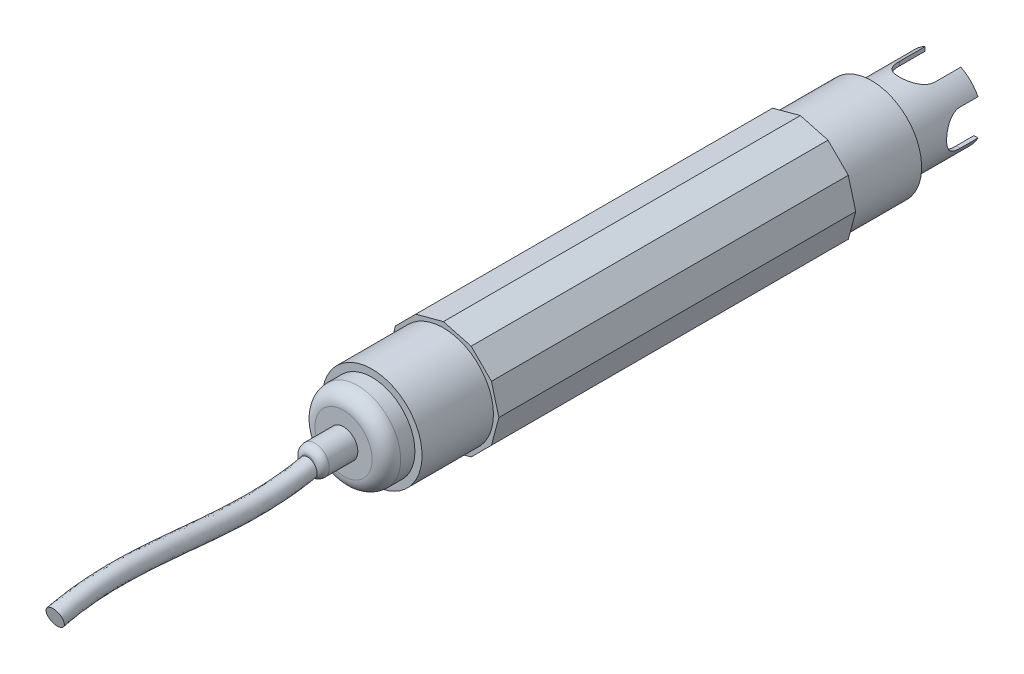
from build123d import *

# Parameters (mm, degrees)
BOSS_EXTRUDE1_DEPTH            = 100
SKETCH2_R                      = 14
BOSS_EXTRUDE2_DEPTH            = 20
SKETCH3_R                      = 12
BOSS_EXTRUDE3_DEPTH            = 8
FILLET1_R                      = 4
SKETCH4_R                      = 4
BOSS_EXTRUDE4_DEPTH            = 10
FILLET2_R                      = 2
BOSS_EXTRUDE6_START            = 20
SKETCH6_R                      = 14
BOSS_EXTRUDE6_DEPTH            = 20
SKETCH7_R                      = 11
SKETCH7_R_2                    = 10
BOSS_EXTRUDE7_DEPTH            = 20
CUT_EXTRUDE1_REACH             = 143.712
CUT_EXTRUDE1_DIRECTION_2_REACH = 143.712
CUT_EXTRUDE2_REACH             = 143.712
CUT_EXTRUDE2_DIRECTION_2_REACH = 143.712
SKETCH10_R                     = 10
BOSS_EXTRUDE8_DEPTH            = 8
SKETCH11_R                     = 3
BOSS_EXTRUDE9_DEPTH            = 6
FILLET3_R                      = 3
SWEEP1_PROFILE_R               = 2.5


with BuildPart() as part:
    # Sketch1 → Boss-Extrude1 (new body)
    with BuildSketch(Plane.XY):
        Polygon((-15.529142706, 0), (-13.448632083, -7.764571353), (-7.764571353, -13.448632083), (0, -15.529142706), (7.764571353, -13.448632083), (13.448632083, -7.764571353), (15.529142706, 0), (13.448632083, 7.764571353), (7.764571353, 13.448632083), (0, 15.529142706), (-7.764571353, 13.448632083), (-13.448632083, 7.764571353), align=None)
    extrude(amount=-BOSS_EXTRUDE1_DEPTH)

    # Sketch2 → Boss-Extrude2 (add)
    with BuildSketch(Plane.XY):
        Circle(SKETCH2_R)
    extrude(amount=BOSS_EXTRUDE2_DEPTH)

    # Sketch3 → Boss-Extrude3 (add)
    with BuildSketch(Plane.XY.offset(20)):
        Circle(SKETCH3_R)
    extrude(amount=BOSS_EXTRUDE3_DEPTH)

    # Fillet1
    fillet1_edges = [part.edges().sort_by_distance(p)[0] for p in [
        (-12, 0, 28),
    ]]
    fillet(fillet1_edges, radius=FILLET1_R)

    # Sketch4 → Boss-Extrude4 (add)
    with BuildSketch(Plane.XY.offset(28)):
        Circle(SKETCH4_R)
    extrude(amount=BOSS_EXTRUDE4_DEPTH)

    # Fillet2
    fillet2_edges = [part.edges().sort_by_distance(p)[0] for p in [
        (-4, 0, 38),
    ]]
    fillet(fillet2_edges, radius=FILLET2_R)

    # Sketch6 → Boss-Extrude6 (add)
    with BuildSketch(Plane(origin=(0, 0, -100), x_dir=(-1, 0, 0), z_dir=(0, 0, -1)).offset(BOSS_EXTRUDE6_START)):
        with Locations(Location((0, 0, 0), (0, 0, 180))):
            Circle(SKETCH6_R)
    extrude(amount=-BOSS_EXTRUDE6_DEPTH)

    # Sketch7 → Boss-Extrude7 (add)
    with BuildSketch(Plane(origin=(0, 0, -120), x_dir=(-1, 0, 0), z_dir=(0, 0, -1))):
        Circle(SKETCH7_R)
        Circle(SKETCH7_R_2, mode=Mode.SUBTRACT)
    extrude(amount=BOSS_EXTRUDE7_DEPTH)

    # Sketch8 → Cut-Extrude1 (cut, up to next)
    with BuildSketch(Plane(origin=(0, 0, 0), x_dir=(0, 0, -1), z_dir=(1, 0, 0)), mode=Mode.PRIVATE) as cut_extrude1_sk1:
        with BuildLine():
            Line((145, -5), (135, -5))
            ThreePointArc((135, -5), (130, 0), (135, 5))
            Line((135, 5), (145, 5))
            Line((145, 5), (145, -5))
        make_face()
    cut_extrude1_tool1 = extrude(cut_extrude1_sk1.sketch, amount=-CUT_EXTRUDE1_REACH, mode=Mode.PRIVATE) & part.part
    add(cut_extrude1_tool1.solids().sort_by_distance((0, 0, -137.991792))[0], mode=Mode.SUBTRACT)

    # Sketch8 → Cut-Extrude1 direction 2 (cut, up to next)
    with BuildSketch(Plane(origin=(0, 0, 0), x_dir=(0, 0, -1), z_dir=(1, 0, 0)), mode=Mode.PRIVATE) as cut_extrude1_direction_2_sk1:
        with BuildLine():
            Line((145, -5), (135, -5))
            ThreePointArc((135, -5), (130, 0), (135, 5))
            Line((135, 5), (145, 5))
            Line((145, 5), (145, -5))
        make_face()
    cut_extrude1_direction_2_tool1 = extrude(cut_extrude1_direction_2_sk1.sketch, amount=CUT_EXTRUDE1_DIRECTION_2_REACH, mode=Mode.PRIVATE) & part.part
    add(cut_extrude1_direction_2_tool1.solids().sort_by_distance((0, 0, -137.991792))[0], mode=Mode.SUBTRACT)

    # Sketch9 → Cut-Extrude2 (cut, up to next)
    with BuildSketch(Plane(origin=(0, 0, 0), x_dir=(1, 0, 0), z_dir=(0, 1, 0)), mode=Mode.PRIVATE) as cut_extrude2_sk1:
        with BuildLine():
            Line((-5, 132.755823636), (-5, 147.244176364))
            Line((-5, 147.244176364), (5, 147.244176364))
            Line((5, 147.244176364), (5, 132.755823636))
            ThreePointArc((5, 132.755823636), (0, 127.755823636), (-5, 132.755823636))
        make_face()
    cut_extrude2_tool1 = extrude(cut_extrude2_sk1.sketch, amount=-CUT_EXTRUDE2_REACH, mode=Mode.PRIVATE) & part.part
    add(cut_extrude2_tool1.solids().sort_by_distance((0, 0, -138.00269))[0], mode=Mode.SUBTRACT)

    # Sketch9 → Cut-Extrude2 direction 2 (cut, up to next)
    with BuildSketch(Plane(origin=(0, 0, 0), x_dir=(1, 0, 0), z_dir=(0, 1, 0)), mode=Mode.PRIVATE) as cut_extrude2_direction_2_sk1:
        with BuildLine():
            Line((-5, 132.755823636), (-5, 147.244176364))
            Line((-5, 147.244176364), (5, 147.244176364))
            Line((5, 147.244176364), (5, 132.755823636))
            ThreePointArc((5, 132.755823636), (0, 127.755823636), (-5, 132.755823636))
        make_face()
    cut_extrude2_direction_2_tool1 = extrude(cut_extrude2_direction_2_sk1.sketch, amount=CUT_EXTRUDE2_DIRECTION_2_REACH, mode=Mode.PRIVATE) & part.part
    add(cut_extrude2_direction_2_tool1.solids().sort_by_distance((0, 0, -138.00269))[0], mode=Mode.SUBTRACT)

    # Sketch10 → Boss-Extrude8 (add)
    with BuildSketch(Plane(origin=(0, 0, -120), x_dir=(-1, 0, 0), z_dir=(0, 0, -1))):
        Circle(SKETCH10_R)
    extrude(amount=BOSS_EXTRUDE8_DEPTH)

    # Sketch11 → Boss-Extrude9 (add)
    with BuildSketch(Plane(origin=(0, 0, -128), x_dir=(-1, 0, 0), z_dir=(0, 0, -1))):
        Circle(SKETCH11_R)
    extrude(amount=BOSS_EXTRUDE9_DEPTH)

    # Fillet3
    fillet3_edges = [part.edges().sort_by_distance(p)[0] for p in [
        (3, 0, -134),
    ]]
    fillet(fillet3_edges, radius=FILLET3_R)

    # Sweep1: sweep along a path in Sketch23
    with BuildLine() as sweep1_path:  # in the path sketch's own coordinates; laid on its plane below (add() does not lay a ready-made edge on the line's plane)
        add(Edge.make_bspline(
            [(-34.218256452, 0), (-59.08096762, -6.905121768), (-83.985922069, 4.252508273), (-108.81618997, -1.844268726)],
            knots=[0, 0, 0, 0, 1, 1, 1, 1], degree=3))
    # Sweep1 profile (on start of the path) → Sweep1 (sweep)
    with BuildSketch(Plane(origin=(0, 0, 34.218256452), x_dir=(0, 0.9635297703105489, 0.267601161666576), z_dir=(0, -0.267601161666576, 0.9635297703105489))):
        Circle(SWEEP1_PROFILE_R)
    sweep(path=Plane(origin=(0, 0, 0), x_dir=(0, 0, -1), z_dir=(1, 0, 0)) * sweep1_path.line)


solid = part.part
